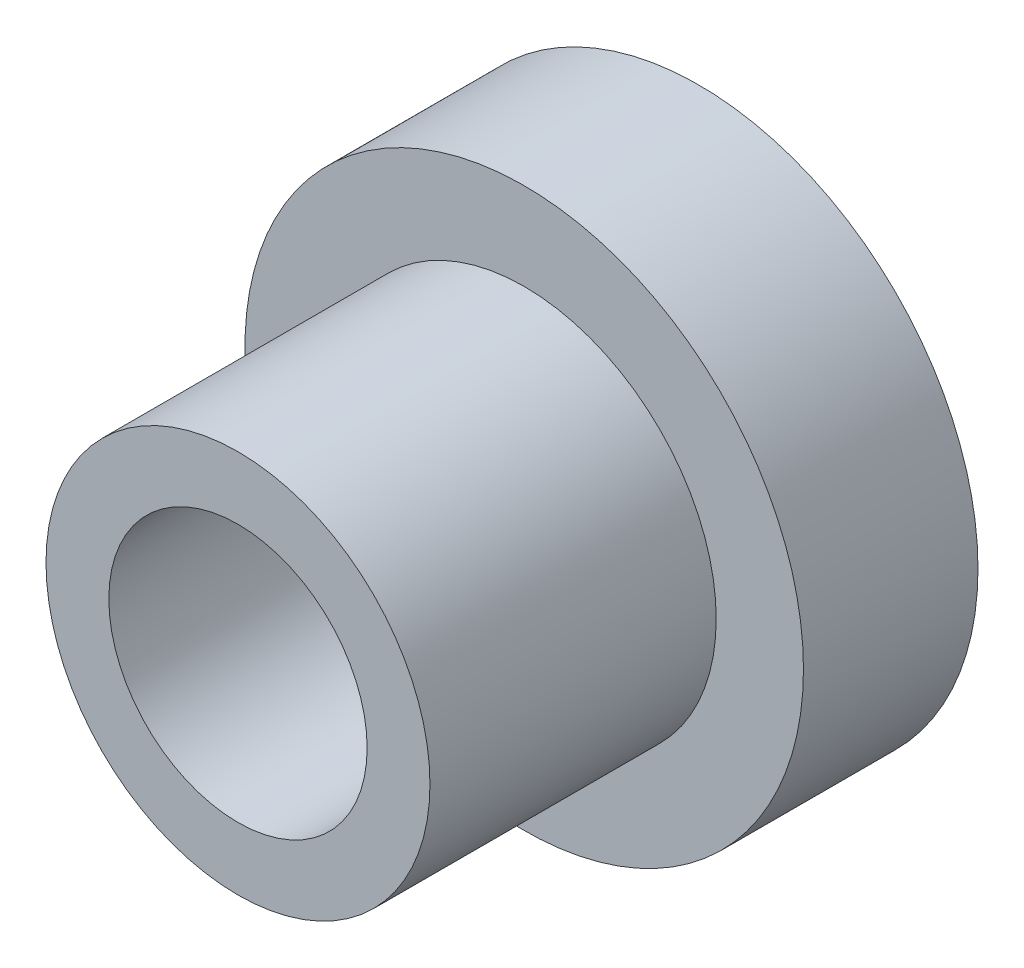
ISO-10303-21;
HEADER;
FILE_DESCRIPTION(('STEP AP214'),'2;1');
FILE_NAME('part.step','',(''),(''),'','','');
FILE_SCHEMA(('AUTOMOTIVE_DESIGN { 1 0 10303 214 1 1 1 1 }'));
ENDSEC;
DATA;
#1=APPLICATION_CONTEXT('core data for automotive mechanical design processes');
#2=APPLICATION_PROTOCOL_DEFINITION('international standard','automotive_design',2000,#1);
#3=PRODUCT_CONTEXT('',#1,'mechanical');
#4=PRODUCT('Part','Part','',(#3));
#5=PRODUCT_RELATED_PRODUCT_CATEGORY('part','',(#4));
#6=PRODUCT_DEFINITION_FORMATION('','',#4);
#7=PRODUCT_DEFINITION_CONTEXT('part definition',#1,'design');
#8=PRODUCT_DEFINITION('design','',#6,#7);
#9=PRODUCT_DEFINITION_SHAPE('','',#8);
#10=(LENGTH_UNIT() NAMED_UNIT(*) SI_UNIT(.MILLI.,.METRE.));
#11=(NAMED_UNIT(*) PLANE_ANGLE_UNIT() SI_UNIT($,.RADIAN.));
#12=(NAMED_UNIT(*) SI_UNIT($,.STERADIAN.) SOLID_ANGLE_UNIT());
#13=UNCERTAINTY_MEASURE_WITH_UNIT(LENGTH_MEASURE(1.E-05),#10,'distance_accuracy_value','');
#14=(GEOMETRIC_REPRESENTATION_CONTEXT(3) GLOBAL_UNCERTAINTY_ASSIGNED_CONTEXT((#13)) GLOBAL_UNIT_ASSIGNED_CONTEXT((#10,
#11,#12)) REPRESENTATION_CONTEXT('',''));
#15=CARTESIAN_POINT('',(0.,0.,0.));
#16=DIRECTION('',(0.,0.,1.));
#17=DIRECTION('',(1.,0.,0.));
#18=AXIS2_PLACEMENT_3D('',#15,#16,#17);
#19=CARTESIAN_POINT('',(0.,0.,6.35));
#20=DIRECTION('',(0.,0.,-1.));
#21=DIRECTION('',(-1.,0.,0.));
#22=AXIS2_PLACEMENT_3D('',#19,#20,#21);
#23=CYLINDRICAL_SURFACE('',#22,10.16);
#24=CARTESIAN_POINT('',(0.,0.,6.35));
#25=DIRECTION('',(0.,0.,1.));
#26=DIRECTION('',(1.,0.,0.));
#27=AXIS2_PLACEMENT_3D('',#24,#25,#26);
#28=CIRCLE('',#27,10.16);
#29=CARTESIAN_POINT('',(10.16,0.,6.35));
#30=VERTEX_POINT('',#29);
#31=EDGE_CURVE('E57',#30,#30,#28,.T.);
#32=ORIENTED_EDGE('',*,*,#31,.F.);
#33=EDGE_LOOP('',(#32));
#34=FACE_BOUND('',#33,.T.);
#35=CARTESIAN_POINT('',(0.,0.,0.));
#36=DIRECTION('',(0.,0.,1.));
#37=DIRECTION('',(1.,0.,0.));
#38=AXIS2_PLACEMENT_3D('',#35,#36,#37);
#39=CIRCLE('',#38,10.16);
#40=CARTESIAN_POINT('',(10.16,0.,0.));
#41=VERTEX_POINT('',#40);
#42=EDGE_CURVE('E52',#41,#41,#39,.T.);
#43=ORIENTED_EDGE('',*,*,#42,.T.);
#44=EDGE_LOOP('',(#43));
#45=FACE_BOUND('',#44,.T.);
#46=ADVANCED_FACE('F49',(#34,#45),#23,.T.);
#47=CARTESIAN_POINT('',(0.,0.,6.35));
#48=DIRECTION('',(0.,0.,1.));
#49=DIRECTION('',(1.,0.,0.));
#50=AXIS2_PLACEMENT_3D('',#47,#48,#49);
#51=PLANE('',#50);
#52=CARTESIAN_POINT('',(0.,0.,6.35));
#53=DIRECTION('',(0.,0.,1.));
#54=DIRECTION('',(1.,0.,0.));
#55=AXIS2_PLACEMENT_3D('',#52,#53,#54);
#56=CIRCLE('',#55,6.985);
#57=CARTESIAN_POINT('',(6.985,0.,6.35));
#58=VERTEX_POINT('',#57);
#59=EDGE_CURVE('E12',#58,#58,#56,.T.);
#60=ORIENTED_EDGE('',*,*,#59,.F.);
#61=EDGE_LOOP('',(#60));
#62=FACE_BOUND('',#61,.T.);
#63=ORIENTED_EDGE('',*,*,#31,.T.);
#64=EDGE_LOOP('',(#63));
#65=FACE_BOUND('',#64,.T.);
#66=ADVANCED_FACE('F98',(#62,#65),#51,.T.);
#67=CARTESIAN_POINT('',(0.,0.,0.));
#68=DIRECTION('',(0.,0.,1.));
#69=DIRECTION('',(1.,0.,0.));
#70=AXIS2_PLACEMENT_3D('',#67,#68,#69);
#71=PLANE('',#70);
#72=CARTESIAN_POINT('',(0.,0.,0.));
#73=DIRECTION('',(0.,0.,1.));
#74=DIRECTION('',(1.,0.,0.));
#75=AXIS2_PLACEMENT_3D('',#72,#73,#74);
#76=CIRCLE('',#75,4.699);
#77=CARTESIAN_POINT('',(4.699,0.,0.));
#78=VERTEX_POINT('',#77);
#79=EDGE_CURVE('E68',#78,#78,#76,.T.);
#80=ORIENTED_EDGE('',*,*,#79,.T.);
#81=EDGE_LOOP('',(#80));
#82=FACE_BOUND('',#81,.T.);
#83=ORIENTED_EDGE('',*,*,#42,.F.);
#84=EDGE_LOOP('',(#83));
#85=FACE_BOUND('',#84,.T.);
#86=ADVANCED_FACE('F77',(#82,#85),#71,.F.);
#87=CARTESIAN_POINT('',(0.,0.,16.764));
#88=DIRECTION('',(0.,0.,-1.));
#89=DIRECTION('',(-1.,0.,0.));
#90=AXIS2_PLACEMENT_3D('',#87,#88,#89);
#91=CYLINDRICAL_SURFACE('',#90,6.985);
#92=CARTESIAN_POINT('',(0.,0.,16.764));
#93=DIRECTION('',(0.,0.,1.));
#94=DIRECTION('',(1.,0.,0.));
#95=AXIS2_PLACEMENT_3D('',#92,#93,#94);
#96=CIRCLE('',#95,6.985);
#97=CARTESIAN_POINT('',(6.985,0.,16.764));
#98=VERTEX_POINT('',#97);
#99=EDGE_CURVE('E64',#98,#98,#96,.T.);
#100=ORIENTED_EDGE('',*,*,#99,.F.);
#101=EDGE_LOOP('',(#100));
#102=FACE_BOUND('',#101,.T.);
#103=ORIENTED_EDGE('',*,*,#59,.T.);
#104=EDGE_LOOP('',(#103));
#105=FACE_BOUND('',#104,.T.);
#106=ADVANCED_FACE('F89',(#102,#105),#91,.T.);
#107=CARTESIAN_POINT('',(0.,0.,16.764));
#108=DIRECTION('',(0.,0.,1.));
#109=DIRECTION('',(1.,0.,0.));
#110=AXIS2_PLACEMENT_3D('',#107,#108,#109);
#111=PLANE('',#110);
#112=CARTESIAN_POINT('',(0.,0.,16.764));
#113=DIRECTION('',(0.,0.,1.));
#114=DIRECTION('',(1.,0.,0.));
#115=AXIS2_PLACEMENT_3D('',#112,#113,#114);
#116=CIRCLE('',#115,4.699);
#117=CARTESIAN_POINT('',(4.699,0.,16.764));
#118=VERTEX_POINT('',#117);
#119=EDGE_CURVE('E69',#118,#118,#116,.T.);
#120=ORIENTED_EDGE('',*,*,#119,.F.);
#121=EDGE_LOOP('',(#120));
#122=FACE_BOUND('',#121,.T.);
#123=ORIENTED_EDGE('',*,*,#99,.T.);
#124=EDGE_LOOP('',(#123));
#125=FACE_BOUND('',#124,.T.);
#126=ADVANCED_FACE('F83',(#122,#125),#111,.T.);
#127=CARTESIAN_POINT('',(0.,0.,0.));
#128=DIRECTION('',(0.,0.,1.));
#129=DIRECTION('',(1.,0.,0.));
#130=AXIS2_PLACEMENT_3D('',#127,#128,#129);
#131=CYLINDRICAL_SURFACE('',#130,4.699);
#132=ORIENTED_EDGE('',*,*,#79,.F.);
#133=EDGE_LOOP('',(#132));
#134=FACE_BOUND('',#133,.T.);
#135=ORIENTED_EDGE('',*,*,#119,.T.);
#136=EDGE_LOOP('',(#135));
#137=FACE_BOUND('',#136,.T.);
#138=ADVANCED_FACE('F80',(#134,#137),#131,.F.);
#139=CLOSED_SHELL('',(#46,#66,#86,#106,#126,#138));
#140=MANIFOLD_SOLID_BREP('B2',#139);
#141=ADVANCED_BREP_SHAPE_REPRESENTATION('',(#18,#140),#14);
#142=SHAPE_DEFINITION_REPRESENTATION(#9,#141);
ENDSEC;
END-ISO-10303-21;
